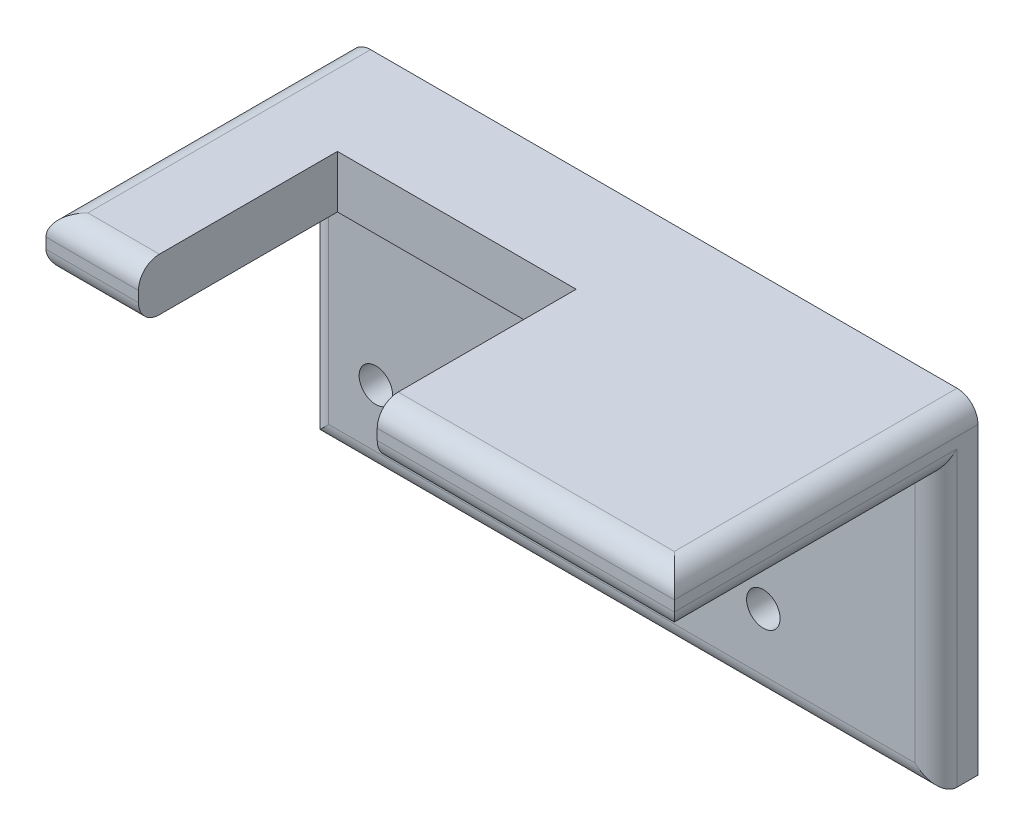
ISO-10303-21;
HEADER;
FILE_DESCRIPTION(('STEP AP214'),'2;1');
FILE_NAME('part.step','',(''),(''),'','','');
FILE_SCHEMA(('AUTOMOTIVE_DESIGN { 1 0 10303 214 1 1 1 1 }'));
ENDSEC;
DATA;
#1=APPLICATION_CONTEXT('core data for automotive mechanical design processes');
#2=APPLICATION_PROTOCOL_DEFINITION('international standard','automotive_design',2000,#1);
#3=PRODUCT_CONTEXT('',#1,'mechanical');
#4=PRODUCT('Part','Part','',(#3));
#5=PRODUCT_RELATED_PRODUCT_CATEGORY('part','',(#4));
#6=PRODUCT_DEFINITION_FORMATION('','',#4);
#7=PRODUCT_DEFINITION_CONTEXT('part definition',#1,'design');
#8=PRODUCT_DEFINITION('design','',#6,#7);
#9=PRODUCT_DEFINITION_SHAPE('','',#8);
#10=(LENGTH_UNIT() NAMED_UNIT(*) SI_UNIT(.MILLI.,.METRE.));
#11=(NAMED_UNIT(*) PLANE_ANGLE_UNIT() SI_UNIT($,.RADIAN.));
#12=(NAMED_UNIT(*) SI_UNIT($,.STERADIAN.) SOLID_ANGLE_UNIT());
#13=UNCERTAINTY_MEASURE_WITH_UNIT(LENGTH_MEASURE(1.E-05),#10,'distance_accuracy_value','');
#14=(GEOMETRIC_REPRESENTATION_CONTEXT(3) GLOBAL_UNCERTAINTY_ASSIGNED_CONTEXT((#13)) GLOBAL_UNIT_ASSIGNED_CONTEXT((#10,
#11,#12)) REPRESENTATION_CONTEXT('',''));
#15=CARTESIAN_POINT('',(0.,0.,0.));
#16=DIRECTION('',(0.,0.,1.));
#17=DIRECTION('',(1.,0.,0.));
#18=AXIS2_PLACEMENT_3D('',#15,#16,#17);
#19=CARTESIAN_POINT('',(0.,0.,29.));
#20=DIRECTION('',(0.,0.,1.));
#21=DIRECTION('',(1.,0.,0.));
#22=AXIS2_PLACEMENT_3D('',#19,#20,#21);
#23=PLANE('',#22);
#24=DIRECTION('',(0.,1.,0.));
#25=VECTOR('',#24,1.);
#26=CARTESIAN_POINT('',(-16.1706930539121,-15.001,29.0000000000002));
#27=LINE('',#26,#25);
#28=CARTESIAN_POINT('',(-16.1706930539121,12.9898505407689,29.));
#29=VERTEX_POINT('',#28);
#30=CARTESIAN_POINT('',(-16.1706930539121,14.,29.));
#31=VERTEX_POINT('',#30);
#32=EDGE_CURVE('E187',#29,#31,#27,.T.);
#33=ORIENTED_EDGE('',*,*,#32,.T.);
#34=DIRECTION('',(-1.,0.,0.));
#35=VECTOR('',#34,1.);
#36=CARTESIAN_POINT('',(-25.,14.,29.));
#37=LINE('',#36,#35);
#38=CARTESIAN_POINT('',(-25.,14.,29.));
#39=VERTEX_POINT('',#38);
#40=EDGE_CURVE('E275',#31,#39,#37,.T.);
#41=ORIENTED_EDGE('',*,*,#40,.T.);
#42=DIRECTION('',(0.,-1.,0.));
#43=VECTOR('',#42,1.);
#44=CARTESIAN_POINT('',(-25.,16.,29.));
#45=LINE('',#44,#43);
#46=CARTESIAN_POINT('',(-25.,12.9898505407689,29.));
#47=VERTEX_POINT('',#46);
#48=EDGE_CURVE('E199',#39,#47,#45,.T.);
#49=ORIENTED_EDGE('',*,*,#48,.T.);
#50=DIRECTION('',(1.,0.,0.));
#51=VECTOR('',#50,1.);
#52=CARTESIAN_POINT('',(-16.1706930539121,12.9898505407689,29.));
#53=LINE('',#52,#51);
#54=EDGE_CURVE('E271',#47,#29,#53,.T.);
#55=ORIENTED_EDGE('',*,*,#54,.T.);
#56=EDGE_LOOP('',(#33,#41,#49,#55));
#57=FACE_BOUND('',#56,.T.);
#58=ADVANCED_FACE('F39',(#57),#23,.T.);
#59=CARTESIAN_POINT('',(0.,0.,4.));
#60=DIRECTION('',(0.,0.,1.));
#61=DIRECTION('',(1.,0.,0.));
#62=AXIS2_PLACEMENT_3D('',#59,#60,#61);
#63=PLANE('',#62);
#64=DIRECTION('',(1.,0.,0.));
#65=VECTOR('',#64,1.);
#66=CARTESIAN_POINT('',(-25.,10.9898505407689,4.));
#67=LINE('',#66,#65);
#68=CARTESIAN_POINT('',(-23.,10.9898505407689,4.));
#69=VERTEX_POINT('',#68);
#70=CARTESIAN_POINT('',(33.,10.9898505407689,4.));
#71=VERTEX_POINT('',#70);
#72=EDGE_CURVE('E195',#69,#71,#67,.T.);
#73=ORIENTED_EDGE('',*,*,#72,.F.);
#74=DIRECTION('',(0.,-1.,0.));
#75=VECTOR('',#74,1.);
#76=CARTESIAN_POINT('',(-23.,-15.,4.));
#77=LINE('',#76,#75);
#78=CARTESIAN_POINT('',(-23.,-13.,4.));
#79=VERTEX_POINT('',#78);
#80=EDGE_CURVE('E331',#69,#79,#77,.T.);
#81=ORIENTED_EDGE('',*,*,#80,.T.);
#82=DIRECTION('',(1.,0.,0.));
#83=VECTOR('',#82,1.);
#84=CARTESIAN_POINT('',(35.,-13.,4.));
#85=LINE('',#84,#83);
#86=CARTESIAN_POINT('',(33.,-13.,4.));
#87=VERTEX_POINT('',#86);
#88=EDGE_CURVE('E328',#79,#87,#85,.T.);
#89=ORIENTED_EDGE('',*,*,#88,.T.);
#90=DIRECTION('',(0.,1.,0.));
#91=VECTOR('',#90,1.);
#92=CARTESIAN_POINT('',(33.,10.9898505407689,4.));
#93=LINE('',#92,#91);
#94=EDGE_CURVE('E325',#87,#71,#93,.T.);
#95=ORIENTED_EDGE('',*,*,#94,.T.);
#96=EDGE_LOOP('',(#73,#81,#89,#95));
#97=FACE_BOUND('',#96,.T.);
#98=CARTESIAN_POINT('',(18.4999999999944,7.49999999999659,4.));
#99=DIRECTION('',(0.,0.,1.));
#100=DIRECTION('',(1.,0.,0.));
#101=AXIS2_PLACEMENT_3D('',#98,#99,#100);
#102=CIRCLE('',#101,1.6);
#103=CARTESIAN_POINT('',(20.0999999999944,7.49999999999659,4.));
#104=VERTEX_POINT('',#103);
#105=EDGE_CURVE('E218',#104,#104,#102,.T.);
#106=ORIENTED_EDGE('',*,*,#105,.F.);
#107=EDGE_LOOP('',(#106));
#108=FACE_BOUND('',#107,.T.);
#109=CARTESIAN_POINT('',(-18.5000000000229,-7.50000000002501,4.));
#110=DIRECTION('',(0.,0.,1.));
#111=DIRECTION('',(1.,0.,0.));
#112=AXIS2_PLACEMENT_3D('',#109,#110,#111);
#113=CIRCLE('',#112,1.6);
#114=CARTESIAN_POINT('',(-16.9000000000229,-7.50000000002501,4.));
#115=VERTEX_POINT('',#114);
#116=EDGE_CURVE('E234',#115,#115,#113,.T.);
#117=ORIENTED_EDGE('',*,*,#116,.F.);
#118=EDGE_LOOP('',(#117));
#119=FACE_BOUND('',#118,.T.);
#120=CARTESIAN_POINT('',(-18.5000000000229,7.49999999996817,4.));
#121=DIRECTION('',(0.,0.,1.));
#122=DIRECTION('',(1.,0.,0.));
#123=AXIS2_PLACEMENT_3D('',#120,#121,#122);
#124=CIRCLE('',#123,1.6);
#125=CARTESIAN_POINT('',(-16.9000000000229,7.49999999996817,4.));
#126=VERTEX_POINT('',#125);
#127=EDGE_CURVE('E242',#126,#126,#124,.T.);
#128=ORIENTED_EDGE('',*,*,#127,.F.);
#129=EDGE_LOOP('',(#128));
#130=FACE_BOUND('',#129,.T.);
#131=CARTESIAN_POINT('',(0.,0.,4.));
#132=DIRECTION('',(0.,0.,1.));
#133=DIRECTION('',(1.,0.,0.));
#134=AXIS2_PLACEMENT_3D('',#131,#132,#133);
#135=CIRCLE('',#134,1.6);
#136=CARTESIAN_POINT('',(1.6,0.,4.));
#137=VERTEX_POINT('',#136);
#138=EDGE_CURVE('E226',#137,#137,#135,.T.);
#139=ORIENTED_EDGE('',*,*,#138,.F.);
#140=EDGE_LOOP('',(#139));
#141=FACE_BOUND('',#140,.T.);
#142=CARTESIAN_POINT('',(18.4999999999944,-7.49999999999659,4.));
#143=DIRECTION('',(0.,0.,1.));
#144=DIRECTION('',(1.,0.,0.));
#145=AXIS2_PLACEMENT_3D('',#142,#143,#144);
#146=CIRCLE('',#145,1.6);
#147=CARTESIAN_POINT('',(20.0999999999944,-7.49999999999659,4.));
#148=VERTEX_POINT('',#147);
#149=EDGE_CURVE('E210',#148,#148,#146,.T.);
#150=ORIENTED_EDGE('',*,*,#149,.F.);
#151=EDGE_LOOP('',(#150));
#152=FACE_BOUND('',#151,.T.);
#153=ADVANCED_FACE('F430',(#97,#108,#119,#130,#141,#152),#63,.T.);
#154=CARTESIAN_POINT('',(0.,0.,0.));
#155=DIRECTION('',(0.,0.,1.));
#156=DIRECTION('',(1.,0.,0.));
#157=AXIS2_PLACEMENT_3D('',#154,#155,#156);
#158=PLANE('',#157);
#159=DIRECTION('',(0.,-1.,0.));
#160=VECTOR('',#159,1.);
#161=CARTESIAN_POINT('',(-25.,16.,0.));
#162=LINE('',#161,#160);
#163=CARTESIAN_POINT('',(-25.,14.,0.));
#164=VERTEX_POINT('',#163);
#165=CARTESIAN_POINT('',(-25.,-15.,0.));
#166=VERTEX_POINT('',#165);
#167=EDGE_CURVE('E246',#164,#166,#162,.T.);
#168=ORIENTED_EDGE('',*,*,#167,.F.);
#169=CARTESIAN_POINT('',(-23.,14.,0.));
#170=DIRECTION('',(0.,0.,1.));
#171=DIRECTION('',(1.,0.,0.));
#172=AXIS2_PLACEMENT_3D('',#169,#170,#171);
#173=CIRCLE('',#172,2.);
#174=CARTESIAN_POINT('',(-23.,16.,0.));
#175=VERTEX_POINT('',#174);
#176=EDGE_CURVE('E310',#164,#175,#173,.F.);
#177=ORIENTED_EDGE('',*,*,#176,.T.);
#178=DIRECTION('',(-1.,0.,0.));
#179=VECTOR('',#178,1.);
#180=CARTESIAN_POINT('',(-25.,16.,0.));
#181=LINE('',#180,#179);
#182=CARTESIAN_POINT('',(33.,16.,0.));
#183=VERTEX_POINT('',#182);
#184=EDGE_CURVE('E261',#183,#175,#181,.T.);
#185=ORIENTED_EDGE('',*,*,#184,.F.);
#186=CARTESIAN_POINT('',(33.,14.,0.));
#187=DIRECTION('',(0.,0.,1.));
#188=DIRECTION('',(1.,0.,0.));
#189=AXIS2_PLACEMENT_3D('',#186,#187,#188);
#190=CIRCLE('',#189,2.);
#191=CARTESIAN_POINT('',(35.,14.,0.));
#192=VERTEX_POINT('',#191);
#193=EDGE_CURVE('E307',#183,#192,#190,.F.);
#194=ORIENTED_EDGE('',*,*,#193,.T.);
#195=DIRECTION('',(0.,1.,0.));
#196=VECTOR('',#195,1.);
#197=CARTESIAN_POINT('',(35.,16.,0.));
#198=LINE('',#197,#196);
#199=CARTESIAN_POINT('',(35.,-15.,0.));
#200=VERTEX_POINT('',#199);
#201=EDGE_CURVE('E257',#200,#192,#198,.T.);
#202=ORIENTED_EDGE('',*,*,#201,.F.);
#203=DIRECTION('',(1.,0.,0.));
#204=VECTOR('',#203,1.);
#205=CARTESIAN_POINT('',(-25.,-15.,0.));
#206=LINE('',#205,#204);
#207=EDGE_CURVE('E253',#166,#200,#206,.T.);
#208=ORIENTED_EDGE('',*,*,#207,.F.);
#209=EDGE_LOOP('',(#168,#177,#185,#194,#202,#208));
#210=FACE_BOUND('',#209,.T.);
#211=CARTESIAN_POINT('',(-18.5000000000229,7.49999999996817,0.));
#212=DIRECTION('',(0.,0.,1.));
#213=DIRECTION('',(1.,0.,0.));
#214=AXIS2_PLACEMENT_3D('',#211,#212,#213);
#215=CIRCLE('',#214,1.6);
#216=CARTESIAN_POINT('',(-16.9000000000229,7.49999999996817,0.));
#217=VERTEX_POINT('',#216);
#218=EDGE_CURVE('E238',#217,#217,#215,.T.);
#219=ORIENTED_EDGE('',*,*,#218,.T.);
#220=EDGE_LOOP('',(#219));
#221=FACE_BOUND('',#220,.T.);
#222=CARTESIAN_POINT('',(-18.5000000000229,-7.50000000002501,0.));
#223=DIRECTION('',(0.,0.,1.));
#224=DIRECTION('',(1.,0.,0.));
#225=AXIS2_PLACEMENT_3D('',#222,#223,#224);
#226=CIRCLE('',#225,1.6);
#227=CARTESIAN_POINT('',(-16.9000000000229,-7.50000000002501,0.));
#228=VERTEX_POINT('',#227);
#229=EDGE_CURVE('E230',#228,#228,#226,.T.);
#230=ORIENTED_EDGE('',*,*,#229,.T.);
#231=EDGE_LOOP('',(#230));
#232=FACE_BOUND('',#231,.T.);
#233=CARTESIAN_POINT('',(0.,0.,0.));
#234=DIRECTION('',(0.,0.,1.));
#235=DIRECTION('',(1.,0.,0.));
#236=AXIS2_PLACEMENT_3D('',#233,#234,#235);
#237=CIRCLE('',#236,1.6);
#238=CARTESIAN_POINT('',(1.6,0.,0.));
#239=VERTEX_POINT('',#238);
#240=EDGE_CURVE('E222',#239,#239,#237,.T.);
#241=ORIENTED_EDGE('',*,*,#240,.T.);
#242=EDGE_LOOP('',(#241));
#243=FACE_BOUND('',#242,.T.);
#244=CARTESIAN_POINT('',(18.4999999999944,7.49999999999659,0.));
#245=DIRECTION('',(0.,0.,1.));
#246=DIRECTION('',(1.,0.,0.));
#247=AXIS2_PLACEMENT_3D('',#244,#245,#246);
#248=CIRCLE('',#247,1.6);
#249=CARTESIAN_POINT('',(20.0999999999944,7.49999999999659,0.));
#250=VERTEX_POINT('',#249);
#251=EDGE_CURVE('E214',#250,#250,#248,.T.);
#252=ORIENTED_EDGE('',*,*,#251,.T.);
#253=EDGE_LOOP('',(#252));
#254=FACE_BOUND('',#253,.T.);
#255=CARTESIAN_POINT('',(18.4999999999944,-7.49999999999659,0.));
#256=DIRECTION('',(0.,0.,1.));
#257=DIRECTION('',(1.,0.,0.));
#258=AXIS2_PLACEMENT_3D('',#255,#256,#257);
#259=CIRCLE('',#258,1.6);
#260=CARTESIAN_POINT('',(20.0999999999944,-7.49999999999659,0.));
#261=VERTEX_POINT('',#260);
#262=EDGE_CURVE('E206',#261,#261,#259,.T.);
#263=ORIENTED_EDGE('',*,*,#262,.T.);
#264=EDGE_LOOP('',(#263));
#265=FACE_BOUND('',#264,.T.);
#266=ADVANCED_FACE('F453',(#210,#221,#232,#243,#254,#265),#158,.F.);
#267=CARTESIAN_POINT('',(-25.,16.,4.));
#268=DIRECTION('',(1.,0.,0.));
#269=DIRECTION('',(0.,0.,-1.));
#270=AXIS2_PLACEMENT_3D('',#267,#268,#269);
#271=PLANE('',#270);
#272=ORIENTED_EDGE('',*,*,#48,.F.);
#273=DIRECTION('',(0.,0.,-1.));
#274=VECTOR('',#273,1.);
#275=CARTESIAN_POINT('',(-25.,14.,4.));
#276=LINE('',#275,#274);
#277=EDGE_CURVE('E304',#39,#164,#276,.T.);
#278=ORIENTED_EDGE('',*,*,#277,.T.);
#279=ORIENTED_EDGE('',*,*,#167,.T.);
#280=DIRECTION('',(0.,0.,-1.));
#281=VECTOR('',#280,1.);
#282=CARTESIAN_POINT('',(-25.,-15.,4.));
#283=LINE('',#282,#281);
#284=CARTESIAN_POINT('',(-25.,-15.,2.));
#285=VERTEX_POINT('',#284);
#286=EDGE_CURVE('E268',#285,#166,#283,.T.);
#287=ORIENTED_EDGE('',*,*,#286,.F.);
#288=DIRECTION('',(0.,-1.,0.));
#289=VECTOR('',#288,1.);
#290=CARTESIAN_POINT('',(-25.,10.9898505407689,2.));
#291=LINE('',#290,#289);
#292=CARTESIAN_POINT('',(-25.,12.9898505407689,2.));
#293=VERTEX_POINT('',#292);
#294=EDGE_CURVE('E298',#285,#293,#291,.F.);
#295=ORIENTED_EDGE('',*,*,#294,.T.);
#296=DIRECTION('',(0.,0.,-1.));
#297=VECTOR('',#296,1.);
#298=CARTESIAN_POINT('',(-25.,12.9898505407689,4.));
#299=LINE('',#298,#297);
#300=EDGE_CURVE('E301',#293,#47,#299,.F.);
#301=ORIENTED_EDGE('',*,*,#300,.T.);
#302=EDGE_LOOP('',(#272,#278,#279,#287,#295,#301));
#303=FACE_BOUND('',#302,.T.);
#304=ADVANCED_FACE('F414',(#303),#271,.F.);
#305=CARTESIAN_POINT('',(-25.,-15.,4.));
#306=DIRECTION('',(0.,1.,0.));
#307=DIRECTION('',(0.,0.,1.));
#308=AXIS2_PLACEMENT_3D('',#305,#306,#307);
#309=PLANE('',#308);
#310=DIRECTION('',(0.,0.,-1.));
#311=VECTOR('',#310,1.);
#312=CARTESIAN_POINT('',(35.,-15.,4.));
#313=LINE('',#312,#311);
#314=CARTESIAN_POINT('',(35.,-15.,2.));
#315=VERTEX_POINT('',#314);
#316=EDGE_CURVE('E265',#315,#200,#313,.T.);
#317=ORIENTED_EDGE('',*,*,#316,.F.);
#318=DIRECTION('',(1.,0.,0.));
#319=VECTOR('',#318,1.);
#320=CARTESIAN_POINT('',(-25.,-15.,2.));
#321=LINE('',#320,#319);
#322=EDGE_CURVE('E334',#315,#285,#321,.F.);
#323=ORIENTED_EDGE('',*,*,#322,.T.);
#324=ORIENTED_EDGE('',*,*,#286,.T.);
#325=ORIENTED_EDGE('',*,*,#207,.T.);
#326=EDGE_LOOP('',(#317,#323,#324,#325));
#327=FACE_BOUND('',#326,.T.);
#328=ADVANCED_FACE('F449',(#327),#309,.F.);
#329=CARTESIAN_POINT('',(35.,16.,4.));
#330=DIRECTION('',(-1.,0.,0.));
#331=DIRECTION('',(0.,-1.,0.));
#332=AXIS2_PLACEMENT_3D('',#329,#330,#331);
#333=PLANE('',#332);
#334=ORIENTED_EDGE('',*,*,#201,.T.);
#335=DIRECTION('',(0.,0.,-1.));
#336=VECTOR('',#335,1.);
#337=CARTESIAN_POINT('',(35.,14.,4.));
#338=LINE('',#337,#336);
#339=CARTESIAN_POINT('',(35.,14.,29.));
#340=VERTEX_POINT('',#339);
#341=EDGE_CURVE('E343',#192,#340,#338,.F.);
#342=ORIENTED_EDGE('',*,*,#341,.T.);
#343=DIRECTION('',(0.,1.,0.));
#344=VECTOR('',#343,1.);
#345=CARTESIAN_POINT('',(35.,16.,29.));
#346=LINE('',#345,#344);
#347=CARTESIAN_POINT('',(35.,12.9898505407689,29.));
#348=VERTEX_POINT('',#347);
#349=EDGE_CURVE('E203',#348,#340,#346,.T.);
#350=ORIENTED_EDGE('',*,*,#349,.F.);
#351=DIRECTION('',(0.,0.,-1.));
#352=VECTOR('',#351,1.);
#353=CARTESIAN_POINT('',(35.,12.9898505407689,4.));
#354=LINE('',#353,#352);
#355=CARTESIAN_POINT('',(35.,12.9898505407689,2.));
#356=VERTEX_POINT('',#355);
#357=EDGE_CURVE('E337',#348,#356,#354,.T.);
#358=ORIENTED_EDGE('',*,*,#357,.T.);
#359=DIRECTION('',(0.,1.,0.));
#360=VECTOR('',#359,1.);
#361=CARTESIAN_POINT('',(35.,-15.,2.));
#362=LINE('',#361,#360);
#363=EDGE_CURVE('E340',#356,#315,#362,.F.);
#364=ORIENTED_EDGE('',*,*,#363,.T.);
#365=ORIENTED_EDGE('',*,*,#316,.T.);
#366=EDGE_LOOP('',(#334,#342,#350,#358,#364,#365));
#367=FACE_BOUND('',#366,.T.);
#368=ADVANCED_FACE('F446',(#367),#333,.F.);
#369=CARTESIAN_POINT('',(-25.,16.,4.));
#370=DIRECTION('',(0.,-1.,0.));
#371=DIRECTION('',(0.,0.,-1.));
#372=AXIS2_PLACEMENT_3D('',#369,#370,#371);
#373=PLANE('',#372);
#374=DIRECTION('',(0.,0.,-1.));
#375=VECTOR('',#374,1.);
#376=CARTESIAN_POINT('',(-23.,16.,4.));
#377=LINE('',#376,#375);
#378=CARTESIAN_POINT('',(-23.,16.,27.));
#379=VERTEX_POINT('',#378);
#380=EDGE_CURVE('E286',#175,#379,#377,.F.);
#381=ORIENTED_EDGE('',*,*,#380,.T.);
#382=DIRECTION('',(-1.,0.,0.));
#383=VECTOR('',#382,1.);
#384=CARTESIAN_POINT('',(-16.1706930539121,16.,27.));
#385=LINE('',#384,#383);
#386=CARTESIAN_POINT('',(-16.1706930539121,16.0000000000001,27.));
#387=VERTEX_POINT('',#386);
#388=EDGE_CURVE('E289',#379,#387,#385,.F.);
#389=ORIENTED_EDGE('',*,*,#388,.T.);
#390=DIRECTION('',(0.,0.,1.));
#391=VECTOR('',#390,1.);
#392=CARTESIAN_POINT('',(-16.1706930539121,16.,10.));
#393=LINE('',#392,#391);
#394=CARTESIAN_POINT('',(-16.1706930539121,16.,10.));
#395=VERTEX_POINT('',#394);
#396=EDGE_CURVE('E170',#395,#387,#393,.T.);
#397=ORIENTED_EDGE('',*,*,#396,.F.);
#398=DIRECTION('',(-1.,0.,0.));
#399=VECTOR('',#398,1.);
#400=CARTESIAN_POINT('',(-16.1706930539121,16.,10.));
#401=LINE('',#400,#399);
#402=CARTESIAN_POINT('',(6.62930694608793,16.,10.));
#403=VERTEX_POINT('',#402);
#404=EDGE_CURVE('E169',#403,#395,#401,.T.);
#405=ORIENTED_EDGE('',*,*,#404,.F.);
#406=DIRECTION('',(0.,0.,-1.));
#407=VECTOR('',#406,1.);
#408=CARTESIAN_POINT('',(6.62930694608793,16.,10.));
#409=LINE('',#408,#407);
#410=CARTESIAN_POINT('',(6.62930694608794,16.0000000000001,27.));
#411=VERTEX_POINT('',#410);
#412=EDGE_CURVE('E159',#411,#403,#409,.T.);
#413=ORIENTED_EDGE('',*,*,#412,.F.);
#414=DIRECTION('',(-1.,0.,0.));
#415=VECTOR('',#414,1.);
#416=CARTESIAN_POINT('',(35.,16.,27.));
#417=LINE('',#416,#415);
#418=CARTESIAN_POINT('',(33.,16.,27.));
#419=VERTEX_POINT('',#418);
#420=EDGE_CURVE('E279',#411,#419,#417,.F.);
#421=ORIENTED_EDGE('',*,*,#420,.T.);
#422=DIRECTION('',(0.,0.,-1.));
#423=VECTOR('',#422,1.);
#424=CARTESIAN_POINT('',(33.,16.,4.));
#425=LINE('',#424,#423);
#426=EDGE_CURVE('E282',#419,#183,#425,.T.);
#427=ORIENTED_EDGE('',*,*,#426,.T.);
#428=ORIENTED_EDGE('',*,*,#184,.T.);
#429=EDGE_LOOP('',(#381,#389,#397,#405,#413,#421,#427,#428));
#430=FACE_BOUND('',#429,.T.);
#431=ADVANCED_FACE('F184',(#430),#373,.F.);
#432=CARTESIAN_POINT('',(-18.5000000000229,7.49999999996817,4.));
#433=DIRECTION('',(0.,0.,-1.));
#434=DIRECTION('',(-1.,0.,0.));
#435=AXIS2_PLACEMENT_3D('',#432,#433,#434);
#436=CYLINDRICAL_SURFACE('',#435,1.6);
#437=ORIENTED_EDGE('',*,*,#127,.T.);
#438=EDGE_LOOP('',(#437));
#439=FACE_BOUND('',#438,.T.);
#440=ORIENTED_EDGE('',*,*,#218,.F.);
#441=EDGE_LOOP('',(#440));
#442=FACE_BOUND('',#441,.T.);
#443=ADVANCED_FACE('F509',(#439,#442),#436,.F.);
#444=CARTESIAN_POINT('',(-18.5000000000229,-7.50000000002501,4.));
#445=DIRECTION('',(0.,0.,-1.));
#446=DIRECTION('',(-1.,0.,0.));
#447=AXIS2_PLACEMENT_3D('',#444,#445,#446);
#448=CYLINDRICAL_SURFACE('',#447,1.6);
#449=ORIENTED_EDGE('',*,*,#116,.T.);
#450=EDGE_LOOP('',(#449));
#451=FACE_BOUND('',#450,.T.);
#452=ORIENTED_EDGE('',*,*,#229,.F.);
#453=EDGE_LOOP('',(#452));
#454=FACE_BOUND('',#453,.T.);
#455=ADVANCED_FACE('F505',(#451,#454),#448,.F.);
#456=CARTESIAN_POINT('',(0.,0.,4.));
#457=DIRECTION('',(0.,0.,-1.));
#458=DIRECTION('',(-1.,0.,0.));
#459=AXIS2_PLACEMENT_3D('',#456,#457,#458);
#460=CYLINDRICAL_SURFACE('',#459,1.6);
#461=ORIENTED_EDGE('',*,*,#138,.T.);
#462=EDGE_LOOP('',(#461));
#463=FACE_BOUND('',#462,.T.);
#464=ORIENTED_EDGE('',*,*,#240,.F.);
#465=EDGE_LOOP('',(#464));
#466=FACE_BOUND('',#465,.T.);
#467=ADVANCED_FACE('F501',(#463,#466),#460,.F.);
#468=CARTESIAN_POINT('',(18.4999999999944,7.49999999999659,4.));
#469=DIRECTION('',(0.,0.,-1.));
#470=DIRECTION('',(-1.,0.,0.));
#471=AXIS2_PLACEMENT_3D('',#468,#469,#470);
#472=CYLINDRICAL_SURFACE('',#471,1.6);
#473=ORIENTED_EDGE('',*,*,#105,.T.);
#474=EDGE_LOOP('',(#473));
#475=FACE_BOUND('',#474,.T.);
#476=ORIENTED_EDGE('',*,*,#251,.F.);
#477=EDGE_LOOP('',(#476));
#478=FACE_BOUND('',#477,.T.);
#479=ADVANCED_FACE('F495',(#475,#478),#472,.F.);
#480=CARTESIAN_POINT('',(18.4999999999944,-7.49999999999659,4.));
#481=DIRECTION('',(0.,0.,-1.));
#482=DIRECTION('',(-1.,0.,0.));
#483=AXIS2_PLACEMENT_3D('',#480,#481,#482);
#484=CYLINDRICAL_SURFACE('',#483,1.6);
#485=ORIENTED_EDGE('',*,*,#149,.T.);
#486=EDGE_LOOP('',(#485));
#487=FACE_BOUND('',#486,.T.);
#488=ORIENTED_EDGE('',*,*,#262,.F.);
#489=EDGE_LOOP('',(#488));
#490=FACE_BOUND('',#489,.T.);
#491=ADVANCED_FACE('F491',(#487,#490),#484,.F.);
#492=CARTESIAN_POINT('',(-25.,10.9898505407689,29.));
#493=DIRECTION('',(0.,1.,0.));
#494=DIRECTION('',(0.,0.,1.));
#495=AXIS2_PLACEMENT_3D('',#492,#493,#494);
#496=PLANE('',#495);
#497=DIRECTION('',(0.,0.,-1.));
#498=VECTOR('',#497,1.);
#499=CARTESIAN_POINT('',(-16.1706930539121,10.9898505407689,10.0000000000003));
#500=LINE('',#499,#498);
#501=CARTESIAN_POINT('',(-16.1706930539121,10.9898505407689,27.));
#502=VERTEX_POINT('',#501);
#503=CARTESIAN_POINT('',(-16.1706930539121,10.9898505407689,10.0000000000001));
#504=VERTEX_POINT('',#503);
#505=EDGE_CURVE('E395',#502,#504,#500,.T.);
#506=ORIENTED_EDGE('',*,*,#505,.F.);
#507=DIRECTION('',(1.,0.,0.));
#508=VECTOR('',#507,1.);
#509=CARTESIAN_POINT('',(-25.,10.9898505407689,27.));
#510=LINE('',#509,#508);
#511=CARTESIAN_POINT('',(-23.,10.9898505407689,27.));
#512=VERTEX_POINT('',#511);
#513=EDGE_CURVE('E322',#502,#512,#510,.F.);
#514=ORIENTED_EDGE('',*,*,#513,.T.);
#515=DIRECTION('',(0.,0.,-1.));
#516=VECTOR('',#515,1.);
#517=CARTESIAN_POINT('',(-23.,10.9898505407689,29.));
#518=LINE('',#517,#516);
#519=EDGE_CURVE('E319',#512,#69,#518,.T.);
#520=ORIENTED_EDGE('',*,*,#519,.T.);
#521=ORIENTED_EDGE('',*,*,#72,.T.);
#522=DIRECTION('',(0.,0.,-1.));
#523=VECTOR('',#522,1.);
#524=CARTESIAN_POINT('',(33.,10.9898505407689,29.));
#525=LINE('',#524,#523);
#526=CARTESIAN_POINT('',(33.,10.9898505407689,27.));
#527=VERTEX_POINT('',#526);
#528=EDGE_CURVE('E316',#71,#527,#525,.F.);
#529=ORIENTED_EDGE('',*,*,#528,.T.);
#530=DIRECTION('',(1.,0.,0.));
#531=VECTOR('',#530,1.);
#532=CARTESIAN_POINT('',(6.62930694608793,10.9898505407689,27.));
#533=LINE('',#532,#531);
#534=CARTESIAN_POINT('',(6.62930694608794,10.9898505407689,27.));
#535=VERTEX_POINT('',#534);
#536=EDGE_CURVE('E313',#527,#535,#533,.F.);
#537=ORIENTED_EDGE('',*,*,#536,.T.);
#538=DIRECTION('',(0.,0.,1.));
#539=VECTOR('',#538,1.);
#540=CARTESIAN_POINT('',(6.62930694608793,10.9898505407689,10.0000000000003));
#541=LINE('',#540,#539);
#542=CARTESIAN_POINT('',(6.62930694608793,10.9898505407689,10.0000000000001));
#543=VERTEX_POINT('',#542);
#544=EDGE_CURVE('E356',#543,#535,#541,.T.);
#545=ORIENTED_EDGE('',*,*,#544,.F.);
#546=DIRECTION('',(1.,0.,0.));
#547=VECTOR('',#546,1.);
#548=CARTESIAN_POINT('',(-16.1706930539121,10.9898505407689,10.0000000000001));
#549=LINE('',#548,#547);
#550=EDGE_CURVE('E178',#504,#543,#549,.T.);
#551=ORIENTED_EDGE('',*,*,#550,.F.);
#552=EDGE_LOOP('',(#506,#514,#520,#521,#529,#537,#545,#551));
#553=FACE_BOUND('',#552,.T.);
#554=ADVANCED_FACE('F391',(#553),#496,.F.);
#555=DIRECTION('',(0.,1.,0.));
#556=VECTOR('',#555,1.);
#557=CARTESIAN_POINT('',(6.62930694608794,-15.001,29.0000000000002));
#558=LINE('',#557,#556);
#559=CARTESIAN_POINT('',(6.62930694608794,12.9898505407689,29.));
#560=VERTEX_POINT('',#559);
#561=CARTESIAN_POINT('',(6.62930694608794,14.,29.));
#562=VERTEX_POINT('',#561);
#563=EDGE_CURVE('E182',#560,#562,#558,.T.);
#564=ORIENTED_EDGE('',*,*,#563,.F.);
#565=DIRECTION('',(1.,0.,0.));
#566=VECTOR('',#565,1.);
#567=CARTESIAN_POINT('',(35.,12.9898505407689,29.));
#568=LINE('',#567,#566);
#569=EDGE_CURVE('E348',#560,#348,#568,.T.);
#570=ORIENTED_EDGE('',*,*,#569,.T.);
#571=ORIENTED_EDGE('',*,*,#349,.T.);
#572=DIRECTION('',(-1.,0.,0.));
#573=VECTOR('',#572,1.);
#574=CARTESIAN_POINT('',(6.62930694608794,14.,29.));
#575=LINE('',#574,#573);
#576=EDGE_CURVE('E57',#340,#562,#575,.T.);
#577=ORIENTED_EDGE('',*,*,#576,.T.);
#578=EDGE_LOOP('',(#564,#570,#571,#577));
#579=FACE_BOUND('',#578,.T.);
#580=ADVANCED_FACE('F479',(#579),#23,.T.);
#581=CARTESIAN_POINT('',(-16.1706930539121,-15.0010000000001,10.0000000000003));
#582=DIRECTION('',(-1.,0.,0.));
#583=DIRECTION('',(0.,0.,1.));
#584=AXIS2_PLACEMENT_3D('',#581,#582,#583);
#585=PLANE('',#584);
#586=ORIENTED_EDGE('',*,*,#396,.T.);
#587=CARTESIAN_POINT('',(-16.1706930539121,14.,27.));
#588=DIRECTION('',(-1.,0.,0.));
#589=DIRECTION('',(0.,0.,1.));
#590=AXIS2_PLACEMENT_3D('',#587,#588,#589);
#591=CIRCLE('',#590,2.);
#592=EDGE_CURVE('E295',#387,#31,#591,.F.);
#593=ORIENTED_EDGE('',*,*,#592,.T.);
#594=ORIENTED_EDGE('',*,*,#32,.F.);
#595=CARTESIAN_POINT('',(-16.1706930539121,12.9898505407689,27.));
#596=DIRECTION('',(-1.,0.,0.));
#597=DIRECTION('',(0.,0.,1.));
#598=AXIS2_PLACEMENT_3D('',#595,#596,#597);
#599=CIRCLE('',#598,2.);
#600=EDGE_CURVE('E292',#29,#502,#599,.F.);
#601=ORIENTED_EDGE('',*,*,#600,.T.);
#602=ORIENTED_EDGE('',*,*,#505,.T.);
#603=DIRECTION('',(0.,1.,0.));
#604=VECTOR('',#603,1.);
#605=CARTESIAN_POINT('',(-16.1706930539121,-15.0010000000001,10.0000000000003));
#606=LINE('',#605,#604);
#607=EDGE_CURVE('E181',#504,#395,#606,.T.);
#608=ORIENTED_EDGE('',*,*,#607,.T.);
#609=EDGE_LOOP('',(#586,#593,#594,#601,#602,#608));
#610=FACE_BOUND('',#609,.T.);
#611=ADVANCED_FACE('F402',(#610),#585,.F.);
#612=CARTESIAN_POINT('',(-16.1706930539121,-15.0010000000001,10.0000000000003));
#613=DIRECTION('',(0.,0.,-1.));
#614=DIRECTION('',(0.,1.,0.));
#615=AXIS2_PLACEMENT_3D('',#612,#613,#614);
#616=PLANE('',#615);
#617=ORIENTED_EDGE('',*,*,#550,.T.);
#618=DIRECTION('',(0.,1.,0.));
#619=VECTOR('',#618,1.);
#620=CARTESIAN_POINT('',(6.62930694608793,-15.0010000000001,10.0000000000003));
#621=LINE('',#620,#619);
#622=EDGE_CURVE('E162',#543,#403,#621,.T.);
#623=ORIENTED_EDGE('',*,*,#622,.T.);
#624=ORIENTED_EDGE('',*,*,#404,.T.);
#625=ORIENTED_EDGE('',*,*,#607,.F.);
#626=EDGE_LOOP('',(#617,#623,#624,#625));
#627=FACE_BOUND('',#626,.T.);
#628=ADVANCED_FACE('F174',(#627),#616,.F.);
#629=CARTESIAN_POINT('',(6.62930694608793,-15.0010000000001,10.0000000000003));
#630=DIRECTION('',(1.,0.,0.));
#631=DIRECTION('',(0.,0.,-1.));
#632=AXIS2_PLACEMENT_3D('',#629,#630,#631);
#633=PLANE('',#632);
#634=ORIENTED_EDGE('',*,*,#544,.T.);
#635=CARTESIAN_POINT('',(6.62930694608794,12.9898505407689,27.));
#636=DIRECTION('',(1.,0.,0.));
#637=DIRECTION('',(0.,0.,-1.));
#638=AXIS2_PLACEMENT_3D('',#635,#636,#637);
#639=CIRCLE('',#638,2.);
#640=EDGE_CURVE('E11',#535,#560,#639,.F.);
#641=ORIENTED_EDGE('',*,*,#640,.T.);
#642=ORIENTED_EDGE('',*,*,#563,.T.);
#643=CARTESIAN_POINT('',(6.62930694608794,14.,27.));
#644=DIRECTION('',(1.,0.,0.));
#645=DIRECTION('',(0.,0.,-1.));
#646=AXIS2_PLACEMENT_3D('',#643,#644,#645);
#647=CIRCLE('',#646,2.);
#648=EDGE_CURVE('E49',#562,#411,#647,.F.);
#649=ORIENTED_EDGE('',*,*,#648,.T.);
#650=ORIENTED_EDGE('',*,*,#412,.T.);
#651=ORIENTED_EDGE('',*,*,#622,.F.);
#652=EDGE_LOOP('',(#634,#641,#642,#649,#650,#651));
#653=FACE_BOUND('',#652,.T.);
#654=ADVANCED_FACE('F161',(#653),#633,.F.);
#655=CARTESIAN_POINT('',(-23.,14.,4.));
#656=DIRECTION('',(0.,0.,-1.));
#657=DIRECTION('',(-1.,0.,0.));
#658=AXIS2_PLACEMENT_3D('',#655,#656,#657);
#659=CYLINDRICAL_SURFACE('',#658,2.);
#660=ORIENTED_EDGE('',*,*,#176,.F.);
#661=ORIENTED_EDGE('',*,*,#277,.F.);
#662=CARTESIAN_POINT('',(-23.,14.,27.));
#663=DIRECTION('',(-0.707106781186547,0.,-0.707106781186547));
#664=DIRECTION('',(0.707106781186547,0.,-0.707106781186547));
#665=AXIS2_PLACEMENT_3D('',#662,#663,#664);
#666=ELLIPSE('',#665,2.82842712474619,2.);
#667=EDGE_CURVE('E353',#379,#39,#666,.F.);
#668=ORIENTED_EDGE('',*,*,#667,.F.);
#669=ORIENTED_EDGE('',*,*,#380,.F.);
#670=EDGE_LOOP('',(#660,#661,#668,#669));
#671=FACE_BOUND('',#670,.T.);
#672=ADVANCED_FACE('F467',(#671),#659,.T.);
#673=CARTESIAN_POINT('',(0.,14.,27.));
#674=DIRECTION('',(1.,0.,0.));
#675=DIRECTION('',(0.,0.,-1.));
#676=AXIS2_PLACEMENT_3D('',#673,#674,#675);
#677=CYLINDRICAL_SURFACE('',#676,2.);
#678=ORIENTED_EDGE('',*,*,#592,.F.);
#679=ORIENTED_EDGE('',*,*,#388,.F.);
#680=ORIENTED_EDGE('',*,*,#667,.T.);
#681=ORIENTED_EDGE('',*,*,#40,.F.);
#682=EDGE_LOOP('',(#678,#679,#680,#681));
#683=FACE_BOUND('',#682,.T.);
#684=ADVANCED_FACE('F407',(#683),#677,.T.);
#685=CARTESIAN_POINT('',(0.,12.9898505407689,27.));
#686=DIRECTION('',(-1.,0.,0.));
#687=DIRECTION('',(0.,0.,1.));
#688=AXIS2_PLACEMENT_3D('',#685,#686,#687);
#689=CYLINDRICAL_SURFACE('',#688,2.);
#690=ORIENTED_EDGE('',*,*,#640,.F.);
#691=ORIENTED_EDGE('',*,*,#536,.F.);
#692=CARTESIAN_POINT('',(33.,12.9898505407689,27.));
#693=DIRECTION('',(-0.707106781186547,0.,0.707106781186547));
#694=DIRECTION('',(-0.707106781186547,0.,-0.707106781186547));
#695=AXIS2_PLACEMENT_3D('',#692,#693,#694);
#696=ELLIPSE('',#695,2.82842712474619,2.);
#697=EDGE_CURVE('E357',#348,#527,#696,.F.);
#698=ORIENTED_EDGE('',*,*,#697,.F.);
#699=ORIENTED_EDGE('',*,*,#569,.F.);
#700=EDGE_LOOP('',(#690,#691,#698,#699));
#701=FACE_BOUND('',#700,.T.);
#702=ADVANCED_FACE('F388',(#701),#689,.T.);
#703=CARTESIAN_POINT('',(33.,12.9898505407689,4.));
#704=DIRECTION('',(0.,0.,-1.));
#705=DIRECTION('',(-1.,0.,0.));
#706=AXIS2_PLACEMENT_3D('',#703,#704,#705);
#707=CYLINDRICAL_SURFACE('',#706,2.);
#708=ORIENTED_EDGE('',*,*,#697,.T.);
#709=ORIENTED_EDGE('',*,*,#528,.F.);
#710=CARTESIAN_POINT('',(33.,12.9898505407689,2.));
#711=DIRECTION('',(0.,-0.707106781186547,-0.707106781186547));
#712=DIRECTION('',(0.,-0.707106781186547,0.707106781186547));
#713=AXIS2_PLACEMENT_3D('',#710,#711,#712);
#714=ELLIPSE('',#713,2.82842712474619,2.);
#715=EDGE_CURVE('E374',#356,#71,#714,.T.);
#716=ORIENTED_EDGE('',*,*,#715,.F.);
#717=ORIENTED_EDGE('',*,*,#357,.F.);
#718=EDGE_LOOP('',(#708,#709,#716,#717));
#719=FACE_BOUND('',#718,.T.);
#720=ADVANCED_FACE('F383',(#719),#707,.T.);
#721=CARTESIAN_POINT('',(33.,0.,2.));
#722=DIRECTION('',(0.,-1.,0.));
#723=DIRECTION('',(1.,0.,0.));
#724=AXIS2_PLACEMENT_3D('',#721,#722,#723);
#725=CYLINDRICAL_SURFACE('',#724,2.);
#726=ORIENTED_EDGE('',*,*,#715,.T.);
#727=ORIENTED_EDGE('',*,*,#94,.F.);
#728=CARTESIAN_POINT('',(33.,-13.,2.));
#729=DIRECTION('',(-0.707106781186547,-0.707106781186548,0.));
#730=DIRECTION('',(0.707106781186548,-0.707106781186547,0.));
#731=AXIS2_PLACEMENT_3D('',#728,#729,#730);
#732=ELLIPSE('',#731,2.82842712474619,2.);
#733=EDGE_CURVE('E370',#315,#87,#732,.T.);
#734=ORIENTED_EDGE('',*,*,#733,.F.);
#735=ORIENTED_EDGE('',*,*,#363,.F.);
#736=EDGE_LOOP('',(#726,#727,#734,#735));
#737=FACE_BOUND('',#736,.T.);
#738=ADVANCED_FACE('F442',(#737),#725,.T.);
#739=CARTESIAN_POINT('',(0.,-13.,2.));
#740=DIRECTION('',(-1.,0.,0.));
#741=DIRECTION('',(0.,0.,1.));
#742=AXIS2_PLACEMENT_3D('',#739,#740,#741);
#743=CYLINDRICAL_SURFACE('',#742,2.);
#744=ORIENTED_EDGE('',*,*,#733,.T.);
#745=ORIENTED_EDGE('',*,*,#88,.F.);
#746=CARTESIAN_POINT('',(-23.,-13.,2.));
#747=DIRECTION('',(-0.707106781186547,0.707106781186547,0.));
#748=DIRECTION('',(-0.707106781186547,-0.707106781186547,0.));
#749=AXIS2_PLACEMENT_3D('',#746,#747,#748);
#750=ELLIPSE('',#749,2.82842712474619,2.);
#751=EDGE_CURVE('E366',#285,#79,#750,.T.);
#752=ORIENTED_EDGE('',*,*,#751,.F.);
#753=ORIENTED_EDGE('',*,*,#322,.F.);
#754=EDGE_LOOP('',(#744,#745,#752,#753));
#755=FACE_BOUND('',#754,.T.);
#756=ADVANCED_FACE('F439',(#755),#743,.T.);
#757=CARTESIAN_POINT('',(-23.,0.,2.));
#758=DIRECTION('',(0.,1.,0.));
#759=DIRECTION('',(0.,0.,1.));
#760=AXIS2_PLACEMENT_3D('',#757,#758,#759);
#761=CYLINDRICAL_SURFACE('',#760,2.);
#762=ORIENTED_EDGE('',*,*,#751,.T.);
#763=ORIENTED_EDGE('',*,*,#80,.F.);
#764=CARTESIAN_POINT('',(-23.,12.9898505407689,2.));
#765=DIRECTION('',(0.,-0.707106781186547,-0.707106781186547));
#766=DIRECTION('',(0.,0.707106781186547,-0.707106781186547));
#767=AXIS2_PLACEMENT_3D('',#764,#765,#766);
#768=ELLIPSE('',#767,2.82842712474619,2.);
#769=EDGE_CURVE('E362',#293,#69,#768,.F.);
#770=ORIENTED_EDGE('',*,*,#769,.F.);
#771=ORIENTED_EDGE('',*,*,#294,.F.);
#772=EDGE_LOOP('',(#762,#763,#770,#771));
#773=FACE_BOUND('',#772,.T.);
#774=ADVANCED_FACE('F435',(#773),#761,.T.);
#775=CARTESIAN_POINT('',(-23.,12.9898505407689,29.));
#776=DIRECTION('',(0.,0.,-1.));
#777=DIRECTION('',(-1.,0.,0.));
#778=AXIS2_PLACEMENT_3D('',#775,#776,#777);
#779=CYLINDRICAL_SURFACE('',#778,2.);
#780=ORIENTED_EDGE('',*,*,#769,.T.);
#781=ORIENTED_EDGE('',*,*,#519,.F.);
#782=CARTESIAN_POINT('',(-23.,12.9898505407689,27.));
#783=DIRECTION('',(-0.707106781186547,0.,-0.707106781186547));
#784=DIRECTION('',(0.707106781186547,0.,-0.707106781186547));
#785=AXIS2_PLACEMENT_3D('',#782,#783,#784);
#786=ELLIPSE('',#785,2.82842712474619,2.);
#787=EDGE_CURVE('E358',#47,#512,#786,.F.);
#788=ORIENTED_EDGE('',*,*,#787,.F.);
#789=ORIENTED_EDGE('',*,*,#300,.F.);
#790=EDGE_LOOP('',(#780,#781,#788,#789));
#791=FACE_BOUND('',#790,.T.);
#792=ADVANCED_FACE('F421',(#791),#779,.T.);
#793=CARTESIAN_POINT('',(0.,12.9898505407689,27.));
#794=DIRECTION('',(-1.,0.,0.));
#795=DIRECTION('',(0.,0.,1.));
#796=AXIS2_PLACEMENT_3D('',#793,#794,#795);
#797=CYLINDRICAL_SURFACE('',#796,2.);
#798=ORIENTED_EDGE('',*,*,#787,.T.);
#799=ORIENTED_EDGE('',*,*,#513,.F.);
#800=ORIENTED_EDGE('',*,*,#600,.F.);
#801=ORIENTED_EDGE('',*,*,#54,.F.);
#802=EDGE_LOOP('',(#798,#799,#800,#801));
#803=FACE_BOUND('',#802,.T.);
#804=ADVANCED_FACE('F426',(#803),#797,.T.);
#805=CARTESIAN_POINT('',(0.,14.,27.));
#806=DIRECTION('',(1.,0.,0.));
#807=DIRECTION('',(0.,0.,-1.));
#808=AXIS2_PLACEMENT_3D('',#805,#806,#807);
#809=CYLINDRICAL_SURFACE('',#808,2.);
#810=ORIENTED_EDGE('',*,*,#648,.F.);
#811=ORIENTED_EDGE('',*,*,#576,.F.);
#812=CARTESIAN_POINT('',(33.,14.,27.));
#813=DIRECTION('',(0.707106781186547,0.,-0.707106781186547));
#814=DIRECTION('',(0.707106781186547,0.,0.707106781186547));
#815=AXIS2_PLACEMENT_3D('',#812,#813,#814);
#816=ELLIPSE('',#815,2.82842712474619,2.);
#817=EDGE_CURVE('E43',#419,#340,#816,.T.);
#818=ORIENTED_EDGE('',*,*,#817,.F.);
#819=ORIENTED_EDGE('',*,*,#420,.F.);
#820=EDGE_LOOP('',(#810,#811,#818,#819));
#821=FACE_BOUND('',#820,.T.);
#822=ADVANCED_FACE('F41',(#821),#809,.T.);
#823=CARTESIAN_POINT('',(33.,14.,4.));
#824=DIRECTION('',(0.,0.,-1.));
#825=DIRECTION('',(-1.,0.,0.));
#826=AXIS2_PLACEMENT_3D('',#823,#824,#825);
#827=CYLINDRICAL_SURFACE('',#826,2.);
#828=ORIENTED_EDGE('',*,*,#817,.T.);
#829=ORIENTED_EDGE('',*,*,#341,.F.);
#830=ORIENTED_EDGE('',*,*,#193,.F.);
#831=ORIENTED_EDGE('',*,*,#426,.F.);
#832=EDGE_LOOP('',(#828,#829,#830,#831));
#833=FACE_BOUND('',#832,.T.);
#834=ADVANCED_FACE('F459',(#833),#827,.T.);
#835=CLOSED_SHELL('',(#58,#153,#266,#304,#328,#368,#431,#443,#455,#467,#479,#491,#554,#580,#611,
#628,#654,#672,#684,#702,#720,#738,#756,#774,#792,#804,#822,#834));
#836=MANIFOLD_SOLID_BREP('B2',#835);
#837=ADVANCED_BREP_SHAPE_REPRESENTATION('',(#18,#836),#14);
#838=SHAPE_DEFINITION_REPRESENTATION(#9,#837);
ENDSEC;
END-ISO-10303-21;
